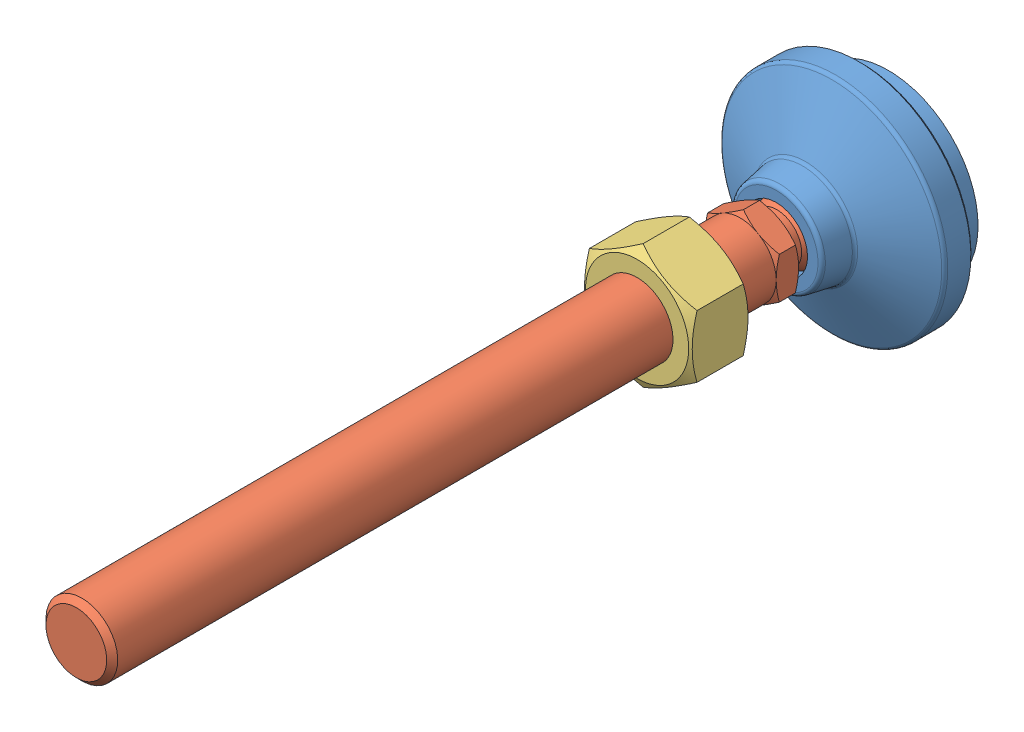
SolidWorks assembly LSVA50-M16X148.sldasm, configuration Default (file format 15000). Lengths in mm.
Overall size (50 50 181).
3 component instances, 3 part files, 0 mates.
Components (placement in the parent):
- LSVA50-M16X148_01-1: LSVA50-M16X148_01.sldprt [ﾃﾞﾌｫﾙﾄ] at (0 0 6) x (1 0 0) z (0 -1 0) size (50 25 50)
- LSVA50-M16X148_02-1: LSVA50-M16X148_02.sldprt [ﾃﾞﾌｫﾙﾄ] at (0 0 13.5) x (1 0 0) z (0 -1 0) size (16 167.5 18.48)
- LSVA50-M16X148_03-1: LSVA50-M16X148_03.sldprt [ﾃﾞﾌｫﾙﾄ] at (0 0 43) size (24 27.71 13)
